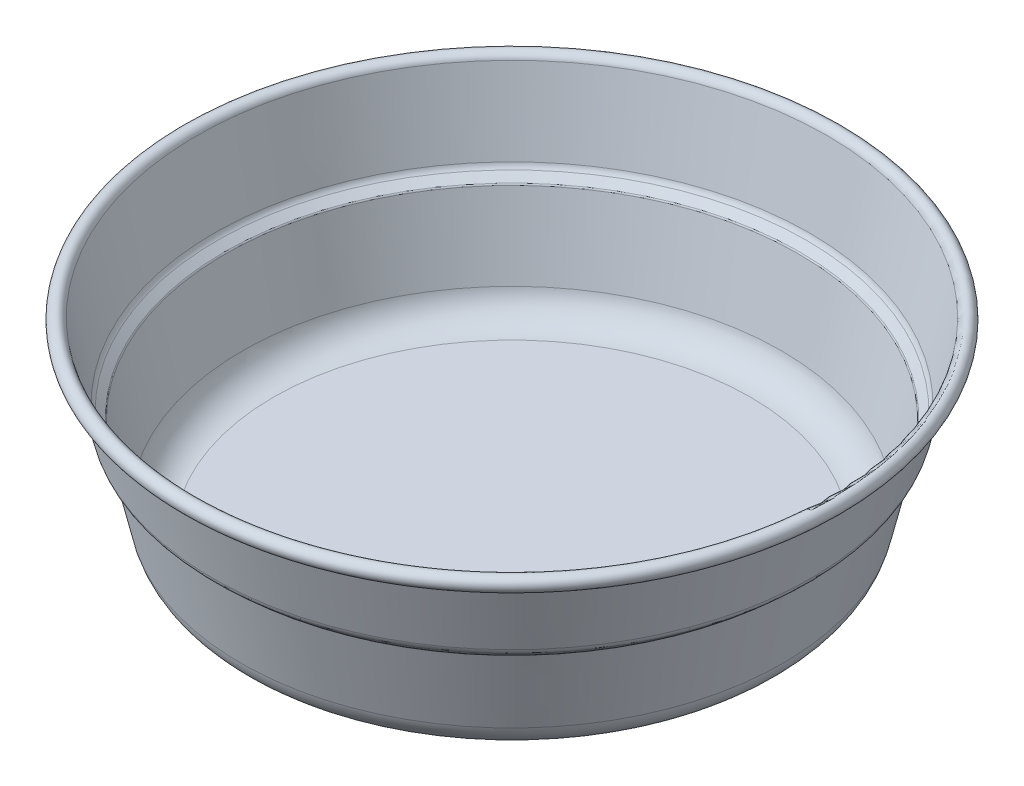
ISO-10303-21;
HEADER;
FILE_DESCRIPTION(('STEP AP214'),'2;1');
FILE_NAME('part.step','',(''),(''),'','','');
FILE_SCHEMA(('AUTOMOTIVE_DESIGN { 1 0 10303 214 1 1 1 1 }'));
ENDSEC;
DATA;
#1=APPLICATION_CONTEXT('core data for automotive mechanical design processes');
#2=APPLICATION_PROTOCOL_DEFINITION('international standard','automotive_design',2000,#1);
#3=PRODUCT_CONTEXT('',#1,'mechanical');
#4=PRODUCT('Part','Part','',(#3));
#5=PRODUCT_RELATED_PRODUCT_CATEGORY('part','',(#4));
#6=PRODUCT_DEFINITION_FORMATION('','',#4);
#7=PRODUCT_DEFINITION_CONTEXT('part definition',#1,'design');
#8=PRODUCT_DEFINITION('design','',#6,#7);
#9=PRODUCT_DEFINITION_SHAPE('','',#8);
#10=(LENGTH_UNIT() NAMED_UNIT(*) SI_UNIT(.MILLI.,.METRE.));
#11=(NAMED_UNIT(*) PLANE_ANGLE_UNIT() SI_UNIT($,.RADIAN.));
#12=(NAMED_UNIT(*) SI_UNIT($,.STERADIAN.) SOLID_ANGLE_UNIT());
#13=UNCERTAINTY_MEASURE_WITH_UNIT(LENGTH_MEASURE(1.E-05),#10,'distance_accuracy_value','');
#14=(GEOMETRIC_REPRESENTATION_CONTEXT(3) GLOBAL_UNCERTAINTY_ASSIGNED_CONTEXT((#13)) GLOBAL_UNIT_ASSIGNED_CONTEXT((#10,
#11,#12)) REPRESENTATION_CONTEXT('',''));
#15=CARTESIAN_POINT('',(0.,0.,0.));
#16=DIRECTION('',(0.,0.,1.));
#17=DIRECTION('',(1.,0.,0.));
#18=AXIS2_PLACEMENT_3D('',#15,#16,#17);
#19=CARTESIAN_POINT('',(0.,0.3,0.));
#20=DIRECTION('',(0.,1.,0.));
#21=DIRECTION('',(0.,0.,1.));
#22=AXIS2_PLACEMENT_3D('',#19,#20,#21);
#23=PLANE('',#22);
#24=CARTESIAN_POINT('',(0.,0.3,0.));
#25=DIRECTION('',(0.,-1.,0.));
#26=DIRECTION('',(0.,0.,-1.));
#27=AXIS2_PLACEMENT_3D('',#24,#25,#26);
#28=CIRCLE('',#27,42.729229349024);
#29=CARTESIAN_POINT('',(0.,0.3,-42.729229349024));
#30=VERTEX_POINT('',#29);
#31=EDGE_CURVE('E10',#30,#30,#28,.T.);
#32=ORIENTED_EDGE('',*,*,#31,.F.);
#33=EDGE_LOOP('',(#32));
#34=FACE_BOUND('',#33,.T.);
#35=ADVANCED_FACE('F24',(#34),#23,.T.);
#36=CARTESIAN_POINT('',(0.,6.,0.));
#37=DIRECTION('',(0.,-1.,0.));
#38=DIRECTION('',(0.,0.,-1.));
#39=AXIS2_PLACEMENT_3D('',#36,#37,#38);
#40=TOROIDAL_SURFACE('',#39,42.729229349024,5.7);
#41=ORIENTED_EDGE('',*,*,#31,.T.);
#42=EDGE_LOOP('',(#41));
#43=FACE_BOUND('',#42,.T.);
#44=CARTESIAN_POINT('',(0.,4.71568693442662,0.));
#45=DIRECTION('',(0.,-1.,0.));
#46=DIRECTION('',(0.,0.,-1.));
#47=AXIS2_PLACEMENT_3D('',#44,#45,#46);
#48=CIRCLE('',#47,48.2826553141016);
#49=CARTESIAN_POINT('',(0.,4.71568693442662,-48.2826553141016));
#50=VERTEX_POINT('',#49);
#51=EDGE_CURVE('E30',#50,#50,#48,.T.);
#52=ORIENTED_EDGE('',*,*,#51,.F.);
#53=EDGE_LOOP('',(#52));
#54=FACE_BOUND('',#53,.T.);
#55=ADVANCED_FACE('F142',(#43,#54),#40,.F.);
#56=CARTESIAN_POINT('',(0.,18.1664958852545,0.));
#57=DIRECTION('',(0.,1.,0.));
#58=DIRECTION('',(0.,0.,1.));
#59=AXIS2_PLACEMENT_3D('',#56,#57,#58);
#60=CONICAL_SURFACE('',#59,51.3933566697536,0.227269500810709);
#61=ORIENTED_EDGE('',*,*,#51,.T.);
#62=EDGE_LOOP('',(#61));
#63=FACE_BOUND('',#62,.T.);
#64=CARTESIAN_POINT('',(0.,18.1664958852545,0.));
#65=DIRECTION('',(0.,-1.,0.));
#66=DIRECTION('',(0.,0.,-1.));
#67=AXIS2_PLACEMENT_3D('',#64,#65,#66);
#68=CIRCLE('',#67,51.3933566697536);
#69=CARTESIAN_POINT('',(0.,18.1664958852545,-51.3933566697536));
#70=VERTEX_POINT('',#69);
#71=EDGE_CURVE('E34',#70,#70,#68,.T.);
#72=ORIENTED_EDGE('',*,*,#71,.F.);
#73=EDGE_LOOP('',(#72));
#74=FACE_BOUND('',#73,.T.);
#75=ADVANCED_FACE('F147',(#63,#74),#60,.F.);
#76=CARTESIAN_POINT('',(0.,18.0538368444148,0.));
#77=DIRECTION('',(0.,-1.,0.));
#78=DIRECTION('',(0.,0.,-1.));
#79=AXIS2_PLACEMENT_3D('',#76,#77,#78);
#80=TOROIDAL_SURFACE('',#79,51.8804992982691,0.500000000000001);
#81=ORIENTED_EDGE('',*,*,#71,.T.);
#82=EDGE_LOOP('',(#81));
#83=FACE_BOUND('',#82,.T.);
#84=CARTESIAN_POINT('',(0.,18.4275415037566,0.));
#85=DIRECTION('',(0.,-1.,0.));
#86=DIRECTION('',(0.,0.,-1.));
#87=AXIS2_PLACEMENT_3D('',#84,#85,#86);
#88=CIRCLE('',#87,51.5483173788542);
#89=CARTESIAN_POINT('',(0.,18.4275415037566,-51.5483173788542));
#90=VERTEX_POINT('',#89);
#91=EDGE_CURVE('E38',#90,#90,#88,.T.);
#92=ORIENTED_EDGE('',*,*,#91,.F.);
#93=EDGE_LOOP('',(#92));
#94=FACE_BOUND('',#93,.T.);
#95=ADVANCED_FACE('F151',(#83,#94),#80,.T.);
#96=CARTESIAN_POINT('',(0.,19.5618598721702,0.));
#97=DIRECTION('',(0.,1.,0.));
#98=DIRECTION('',(0.,0.,1.));
#99=AXIS2_PLACEMENT_3D('',#96,#97,#98);
#100=CONICAL_SURFACE('',#99,52.8244255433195,0.844153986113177);
#101=ORIENTED_EDGE('',*,*,#91,.T.);
#102=EDGE_LOOP('',(#101));
#103=FACE_BOUND('',#102,.T.);
#104=CARTESIAN_POINT('',(0.,19.5618598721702,0.));
#105=DIRECTION('',(0.,-1.,0.));
#106=DIRECTION('',(0.,0.,-1.));
#107=AXIS2_PLACEMENT_3D('',#104,#105,#106);
#108=CIRCLE('',#107,52.8244255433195);
#109=CARTESIAN_POINT('',(0.,19.5618598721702,-52.8244255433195));
#110=VERTEX_POINT('',#109);
#111=EDGE_CURVE('E43',#110,#110,#108,.T.);
#112=ORIENTED_EDGE('',*,*,#111,.F.);
#113=EDGE_LOOP('',(#112));
#114=FACE_BOUND('',#113,.T.);
#115=ADVANCED_FACE('F157',(#103,#114),#100,.F.);
#116=CARTESIAN_POINT('',(0.,20.8324557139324,0.));
#117=DIRECTION('',(0.,-1.,0.));
#118=DIRECTION('',(0.,0.,-1.));
#119=AXIS2_PLACEMENT_3D('',#116,#117,#118);
#120=TOROIDAL_SURFACE('',#119,51.6950070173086,1.7);
#121=ORIENTED_EDGE('',*,*,#111,.T.);
#122=EDGE_LOOP('',(#121));
#123=FACE_BOUND('',#122,.T.);
#124=CARTESIAN_POINT('',(0.,20.4494149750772,0.));
#125=DIRECTION('',(0.,-1.,0.));
#126=DIRECTION('',(0.,0.,-1.));
#127=AXIS2_PLACEMENT_3D('',#124,#125,#126);
#128=CIRCLE('',#127,53.3512919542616);
#129=CARTESIAN_POINT('',(0.,20.4494149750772,-53.3512919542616));
#130=VERTEX_POINT('',#129);
#131=EDGE_CURVE('E46',#130,#130,#128,.T.);
#132=ORIENTED_EDGE('',*,*,#131,.F.);
#133=EDGE_LOOP('',(#132));
#134=FACE_BOUND('',#133,.T.);
#135=ADVANCED_FACE('F138',(#123,#134),#120,.F.);
#136=CARTESIAN_POINT('',(0.,33.9929135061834,0.));
#137=DIRECTION('',(0.,1.,0.));
#138=DIRECTION('',(0.,0.,1.));
#139=AXIS2_PLACEMENT_3D('',#136,#137,#138);
#140=CONICAL_SURFACE('',#139,56.4834291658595,0.227269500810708);
#141=ORIENTED_EDGE('',*,*,#131,.T.);
#142=EDGE_LOOP('',(#141));
#143=FACE_BOUND('',#142,.T.);
#144=CARTESIAN_POINT('',(0.,33.9929135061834,0.));
#145=DIRECTION('',(0.,-1.,0.));
#146=DIRECTION('',(0.,0.,-1.));
#147=AXIS2_PLACEMENT_3D('',#144,#145,#146);
#148=CIRCLE('',#147,56.4834291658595);
#149=CARTESIAN_POINT('',(0.,33.9929135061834,-56.4834291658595));
#150=VERTEX_POINT('',#149);
#151=EDGE_CURVE('E49',#150,#150,#148,.T.);
#152=ORIENTED_EDGE('',*,*,#151,.F.);
#153=EDGE_LOOP('',(#152));
#154=FACE_BOUND('',#153,.T.);
#155=ADVANCED_FACE('F132',(#143,#154),#140,.F.);
#156=CARTESIAN_POINT('',(0.,33.7,0.));
#157=DIRECTION('',(0.,-1.,0.));
#158=DIRECTION('',(0.,0.,-1.));
#159=AXIS2_PLACEMENT_3D('',#156,#157,#158);
#160=TOROIDAL_SURFACE('',#159,57.75,1.30000000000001);
#161=ORIENTED_EDGE('',*,*,#151,.T.);
#162=EDGE_LOOP('',(#161));
#163=FACE_BOUND('',#162,.T.);
#164=CARTESIAN_POINT('',(0.,32.4,0.));
#165=DIRECTION('',(0.,-1.,0.));
#166=DIRECTION('',(0.,0.,-1.));
#167=AXIS2_PLACEMENT_3D('',#164,#165,#166);
#168=CIRCLE('',#167,57.75);
#169=CARTESIAN_POINT('',(0.,32.4,-57.75));
#170=VERTEX_POINT('',#169);
#171=EDGE_CURVE('E52',#170,#170,#168,.T.);
#172=ORIENTED_EDGE('',*,*,#171,.F.);
#173=EDGE_LOOP('',(#172));
#174=FACE_BOUND('',#173,.T.);
#175=ADVANCED_FACE('F127',(#163,#174),#160,.T.);
#176=CARTESIAN_POINT('',(0.,0.,0.));
#177=DIRECTION('',(0.,-1.,0.));
#178=DIRECTION('',(0.,0.,-1.));
#179=AXIS2_PLACEMENT_3D('',#176,#177,#178);
#180=CYLINDRICAL_SURFACE('',#179,57.75);
#181=CARTESIAN_POINT('',(0.,32.7,0.));
#182=DIRECTION('',(0.,-1.,0.));
#183=DIRECTION('',(0.,0.,-1.));
#184=AXIS2_PLACEMENT_3D('',#181,#182,#183);
#185=CIRCLE('',#184,57.75);
#186=CARTESIAN_POINT('',(0.,32.7,-57.75));
#187=VERTEX_POINT('',#186);
#188=EDGE_CURVE('E55',#187,#187,#185,.T.);
#189=ORIENTED_EDGE('',*,*,#188,.F.);
#190=EDGE_LOOP('',(#189));
#191=FACE_BOUND('',#190,.T.);
#192=ORIENTED_EDGE('',*,*,#171,.T.);
#193=EDGE_LOOP('',(#192));
#194=FACE_BOUND('',#193,.T.);
#195=ADVANCED_FACE('F121',(#191,#194),#180,.F.);
#196=CARTESIAN_POINT('',(0.,33.7,0.));
#197=DIRECTION('',(0.,-1.,0.));
#198=DIRECTION('',(0.,0.,-1.));
#199=AXIS2_PLACEMENT_3D('',#196,#197,#198);
#200=TOROIDAL_SURFACE('',#199,57.75,1.00000000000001);
#201=CARTESIAN_POINT('',(0.,33.9253180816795,0.));
#202=DIRECTION('',(0.,-1.,0.));
#203=DIRECTION('',(0.,0.,-1.));
#204=AXIS2_PLACEMENT_3D('',#201,#202,#203);
#205=CIRCLE('',#204,56.7757147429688);
#206=CARTESIAN_POINT('',(0.,33.9253180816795,-56.7757147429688));
#207=VERTEX_POINT('',#206);
#208=EDGE_CURVE('E58',#207,#207,#205,.T.);
#209=ORIENTED_EDGE('',*,*,#208,.F.);
#210=EDGE_LOOP('',(#209));
#211=FACE_BOUND('',#210,.T.);
#212=ORIENTED_EDGE('',*,*,#188,.T.);
#213=EDGE_LOOP('',(#212));
#214=FACE_BOUND('',#213,.T.);
#215=ADVANCED_FACE('F115',(#211,#214),#200,.F.);
#216=CARTESIAN_POINT('',(0.,33.9253180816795,0.));
#217=DIRECTION('',(0.,1.,0.));
#218=DIRECTION('',(0.,0.,1.));
#219=AXIS2_PLACEMENT_3D('',#216,#217,#218);
#220=CONICAL_SURFACE('',#219,56.7757147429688,0.227269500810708);
#221=CARTESIAN_POINT('',(0.,20.3818195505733,0.));
#222=DIRECTION('',(0.,-1.,0.));
#223=DIRECTION('',(0.,0.,-1.));
#224=AXIS2_PLACEMENT_3D('',#221,#222,#223);
#225=CIRCLE('',#224,53.6435775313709);
#226=CARTESIAN_POINT('',(0.,20.3818195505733,-53.6435775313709));
#227=VERTEX_POINT('',#226);
#228=EDGE_CURVE('E61',#227,#227,#225,.T.);
#229=ORIENTED_EDGE('',*,*,#228,.F.);
#230=EDGE_LOOP('',(#229));
#231=FACE_BOUND('',#230,.T.);
#232=ORIENTED_EDGE('',*,*,#208,.T.);
#233=EDGE_LOOP('',(#232));
#234=FACE_BOUND('',#233,.T.);
#235=ADVANCED_FACE('F109',(#231,#234),#220,.T.);
#236=CARTESIAN_POINT('',(0.,20.8324557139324,0.));
#237=DIRECTION('',(0.,-1.,0.));
#238=DIRECTION('',(0.,0.,-1.));
#239=AXIS2_PLACEMENT_3D('',#236,#237,#238);
#240=TOROIDAL_SURFACE('',#239,51.6950070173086,2.);
#241=CARTESIAN_POINT('',(0.,19.3376370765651,0.));
#242=DIRECTION('',(0.,-1.,0.));
#243=DIRECTION('',(0.,0.,-1.));
#244=AXIS2_PLACEMENT_3D('',#241,#242,#243);
#245=CIRCLE('',#244,53.0237346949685);
#246=CARTESIAN_POINT('',(0.,19.3376370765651,-53.0237346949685));
#247=VERTEX_POINT('',#246);
#248=EDGE_CURVE('E64',#247,#247,#245,.T.);
#249=ORIENTED_EDGE('',*,*,#248,.F.);
#250=EDGE_LOOP('',(#249));
#251=FACE_BOUND('',#250,.T.);
#252=ORIENTED_EDGE('',*,*,#228,.T.);
#253=EDGE_LOOP('',(#252));
#254=FACE_BOUND('',#253,.T.);
#255=ADVANCED_FACE('F103',(#251,#254),#240,.T.);
#256=CARTESIAN_POINT('',(0.,19.3376370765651,0.));
#257=DIRECTION('',(0.,1.,0.));
#258=DIRECTION('',(0.,0.,1.));
#259=AXIS2_PLACEMENT_3D('',#256,#257,#258);
#260=CONICAL_SURFACE('',#259,53.0237346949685,0.844153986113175);
#261=CARTESIAN_POINT('',(0.,18.2033187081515,0.));
#262=DIRECTION('',(0.,-1.,0.));
#263=DIRECTION('',(0.,0.,-1.));
#264=AXIS2_PLACEMENT_3D('',#261,#262,#263);
#265=CIRCLE('',#264,51.7476265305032);
#266=CARTESIAN_POINT('',(0.,18.2033187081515,-51.7476265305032));
#267=VERTEX_POINT('',#266);
#268=EDGE_CURVE('E67',#267,#267,#265,.T.);
#269=ORIENTED_EDGE('',*,*,#268,.F.);
#270=EDGE_LOOP('',(#269));
#271=FACE_BOUND('',#270,.T.);
#272=ORIENTED_EDGE('',*,*,#248,.T.);
#273=EDGE_LOOP('',(#272));
#274=FACE_BOUND('',#273,.T.);
#275=ADVANCED_FACE('F97',(#271,#274),#260,.T.);
#276=CARTESIAN_POINT('',(0.,18.0538368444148,0.));
#277=DIRECTION('',(0.,-1.,0.));
#278=DIRECTION('',(0.,0.,-1.));
#279=AXIS2_PLACEMENT_3D('',#276,#277,#278);
#280=TOROIDAL_SURFACE('',#279,51.8804992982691,0.200000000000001);
#281=CARTESIAN_POINT('',(0.,18.0989004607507,0.));
#282=DIRECTION('',(0.,-1.,0.));
#283=DIRECTION('',(0.,0.,-1.));
#284=AXIS2_PLACEMENT_3D('',#281,#282,#283);
#285=CIRCLE('',#284,51.6856422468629);
#286=CARTESIAN_POINT('',(0.,18.0989004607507,-51.6856422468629));
#287=VERTEX_POINT('',#286);
#288=EDGE_CURVE('E70',#287,#287,#285,.T.);
#289=ORIENTED_EDGE('',*,*,#288,.F.);
#290=EDGE_LOOP('',(#289));
#291=FACE_BOUND('',#290,.T.);
#292=ORIENTED_EDGE('',*,*,#268,.T.);
#293=EDGE_LOOP('',(#292));
#294=FACE_BOUND('',#293,.T.);
#295=ADVANCED_FACE('F91',(#291,#294),#280,.F.);
#296=CARTESIAN_POINT('',(0.,18.0989004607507,0.));
#297=DIRECTION('',(0.,1.,0.));
#298=DIRECTION('',(0.,0.,1.));
#299=AXIS2_PLACEMENT_3D('',#296,#297,#298);
#300=CONICAL_SURFACE('',#299,51.6856422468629,0.227269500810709);
#301=CARTESIAN_POINT('',(0.,4.64809150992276,0.));
#302=DIRECTION('',(0.,-1.,0.));
#303=DIRECTION('',(0.,0.,-1.));
#304=AXIS2_PLACEMENT_3D('',#301,#302,#303);
#305=CIRCLE('',#304,48.5749408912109);
#306=CARTESIAN_POINT('',(0.,4.64809150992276,-48.5749408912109));
#307=VERTEX_POINT('',#306);
#308=EDGE_CURVE('E73',#307,#307,#305,.T.);
#309=ORIENTED_EDGE('',*,*,#308,.F.);
#310=EDGE_LOOP('',(#309));
#311=FACE_BOUND('',#310,.T.);
#312=ORIENTED_EDGE('',*,*,#288,.T.);
#313=EDGE_LOOP('',(#312));
#314=FACE_BOUND('',#313,.T.);
#315=ADVANCED_FACE('F85',(#311,#314),#300,.T.);
#316=CARTESIAN_POINT('',(0.,6.,0.));
#317=DIRECTION('',(0.,-1.,0.));
#318=DIRECTION('',(0.,0.,-1.));
#319=AXIS2_PLACEMENT_3D('',#316,#317,#318);
#320=TOROIDAL_SURFACE('',#319,42.729229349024,6.);
#321=CARTESIAN_POINT('',(0.,0.,0.));
#322=DIRECTION('',(0.,-1.,0.));
#323=DIRECTION('',(0.,0.,-1.));
#324=AXIS2_PLACEMENT_3D('',#321,#322,#323);
#325=CIRCLE('',#324,42.729229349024);
#326=CARTESIAN_POINT('',(0.,0.,-42.729229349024));
#327=VERTEX_POINT('',#326);
#328=EDGE_CURVE('E76',#327,#327,#325,.T.);
#329=ORIENTED_EDGE('',*,*,#328,.F.);
#330=EDGE_LOOP('',(#329));
#331=FACE_BOUND('',#330,.T.);
#332=ORIENTED_EDGE('',*,*,#308,.T.);
#333=EDGE_LOOP('',(#332));
#334=FACE_BOUND('',#333,.T.);
#335=ADVANCED_FACE('F82',(#331,#334),#320,.T.);
#336=CARTESIAN_POINT('',(0.,0.,0.));
#337=DIRECTION('',(0.,1.,0.));
#338=DIRECTION('',(0.,0.,1.));
#339=AXIS2_PLACEMENT_3D('',#336,#337,#338);
#340=PLANE('',#339);
#341=ORIENTED_EDGE('',*,*,#328,.T.);
#342=EDGE_LOOP('',(#341));
#343=FACE_BOUND('',#342,.T.);
#344=ADVANCED_FACE('F80',(#343),#340,.F.);
#345=CLOSED_SHELL('',(#35,#55,#75,#95,#115,#135,#155,#175,#195,#215,#235,#255,#275,#295,#315,
#335,#344));
#346=MANIFOLD_SOLID_BREP('B2',#345);
#347=ADVANCED_BREP_SHAPE_REPRESENTATION('',(#18,#346),#14);
#348=SHAPE_DEFINITION_REPRESENTATION(#9,#347);
ENDSEC;
END-ISO-10303-21;
